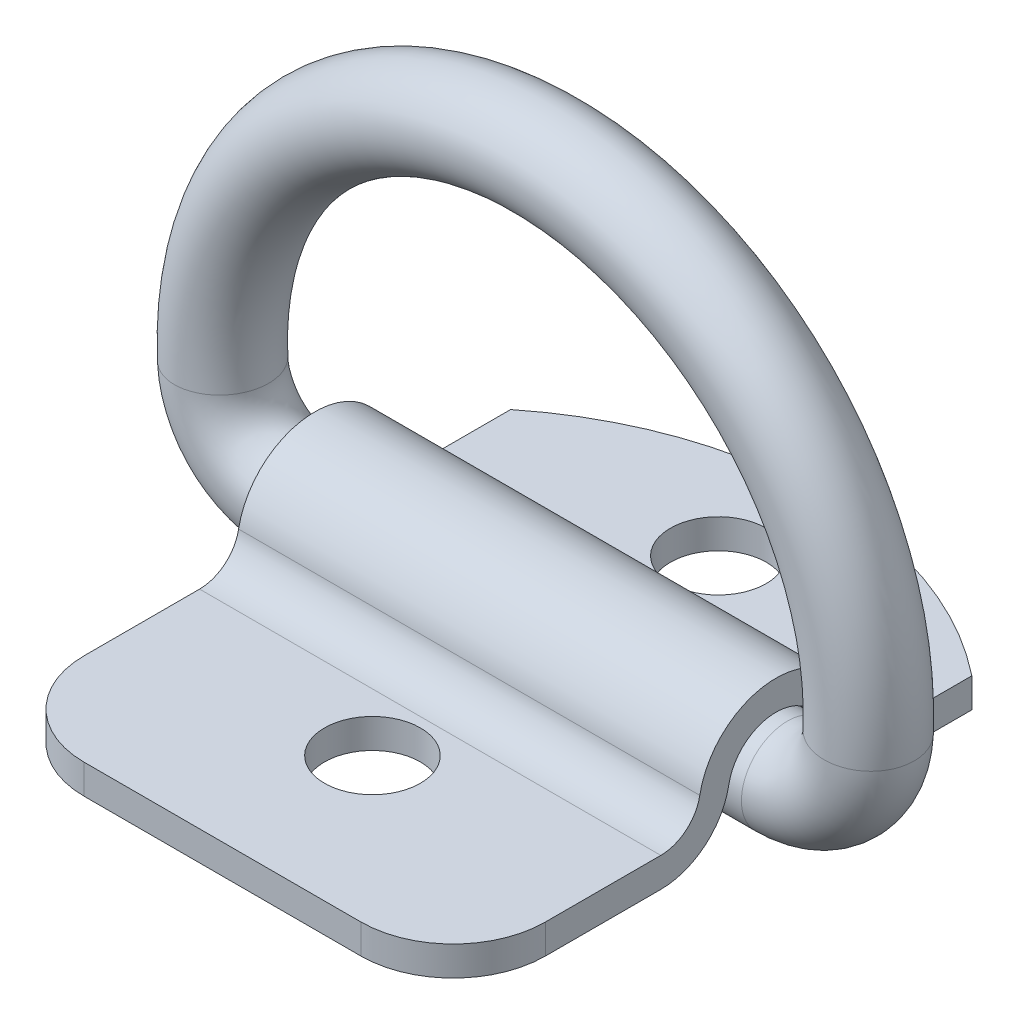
from build123d import *

# Parameters (mm, degrees)
SKETCH2_R           = 3.175
BOSS_EXTRUDE1_DEPTH = 15.875
SKETCH4_R           = 3.302
CUT_EXTRUDE1_DEPTH  = 49.668984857


with BuildPart() as part:
    # Sweep1: sweep along a path in Sketch1
    with BuildLine(Plane.XY) as sweep1_path:
        Line((-16.66875, 0), (16.66875, 0))
        ThreePointArc((16.66875, 0), (20.505205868, 1.537105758), (22.218993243, 5.297959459))
        ThreePointArc((22.218993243, 5.297959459), (0, 28.575), (-22.218993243, 5.297959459))
        ThreePointArc((-22.218993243, 5.297959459), (-20.505205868, 1.537105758), (-16.66875, 0))
    # Sketch2 → Sweep1 (sweep)
    with BuildSketch(Plane(origin=(0, 0, 0), x_dir=(0, 0, -1), z_dir=(1, 0, 0))):
        Circle(SKETCH2_R)
    sweep(path=sweep1_path.line)


with BuildPart() as body_2:
    # Sketch3 → Boss-Extrude1 (new, symmetric)
    with BuildSketch(Plane(origin=(0, 0, 0), x_dir=(0, 0, -1), z_dir=(1, 0, 0))):
        with BuildLine():
            Line((-22.225, -3.302), (-22.225, -1.27))
            Line((-22.225, -1.27), (-7.931147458, -1.27))
            ThreePointArc((-7.931147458, -1.27), (-6.183949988, -0.637816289), (-5.245798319, 0.966))
            ThreePointArc((-5.245798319, 0.966), (0, 5.334), (5.245798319, 0.966))
            ThreePointArc((5.245798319, 0.966), (6.183949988, -0.637816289), (7.931147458, -1.27))
            Line((7.931147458, -1.27), (19.05, -1.27))
            Line((19.05, -1.27), (19.05, -3.302))
            Line((19.05, -3.302), (7.931147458, -3.302))
            ThreePointArc((7.931147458, -3.302), (4.88371001, -2.199353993), (3.247398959, 0.598))
            ThreePointArc((3.247398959, 0.598), (0, 3.302), (-3.247398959, 0.598))
            ThreePointArc((-3.247398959, 0.598), (-4.88371001, -2.199353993), (-7.931147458, -3.302))
            Line((-7.931147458, -3.302), (-22.225, -3.302))
        make_face()
    extrude(amount=BOSS_EXTRUDE1_DEPTH, both=True)

    # Sketch4 → Cut-Extrude1 (cut, through all)
    with BuildSketch(Plane.XZ.offset(3.302)):
        with Locations(Location((0, 11.90625, 0), (0, 0, 270))):
            Circle(SKETCH4_R)
        with Locations(Location((0, -11.90625, 0), (0, 0, 270))):
            Circle(SKETCH4_R)
        with BuildLine():
            Line((-15.875, 15.875), (-15.875, 22.225))
            Line((-15.875, 22.225), (-9.525, 22.225))
            ThreePointArc((-9.525, 22.225), (-14.015128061, 20.365128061), (-15.875, 15.875))
        make_face()
        with BuildLine():
            Line((15.875, 22.225), (9.525, 22.225))
            ThreePointArc((9.525, 22.225), (14.015128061, 20.365128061), (15.875, 15.875))
            Line((15.875, 15.875), (15.875, 22.225))
        make_face()
        with BuildLine():
            Line((15.875, -19.05), (15.875, -13.477868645))
            ThreePointArc((15.875, -13.477868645), (0, -19.05), (-15.875, -13.477868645))
            Line((-15.875, -13.477868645), (-15.875, -19.05))
            Line((-15.875, -19.05), (-15.875, -20.32))
            Line((-15.875, -20.32), (15.875, -20.32))
            Line((15.875, -20.32), (15.875, -19.05))
        make_face()
    extrude(amount=-CUT_EXTRUDE1_DEPTH, mode=Mode.SUBTRACT)


solid = Compound([part.part, body_2.part])
